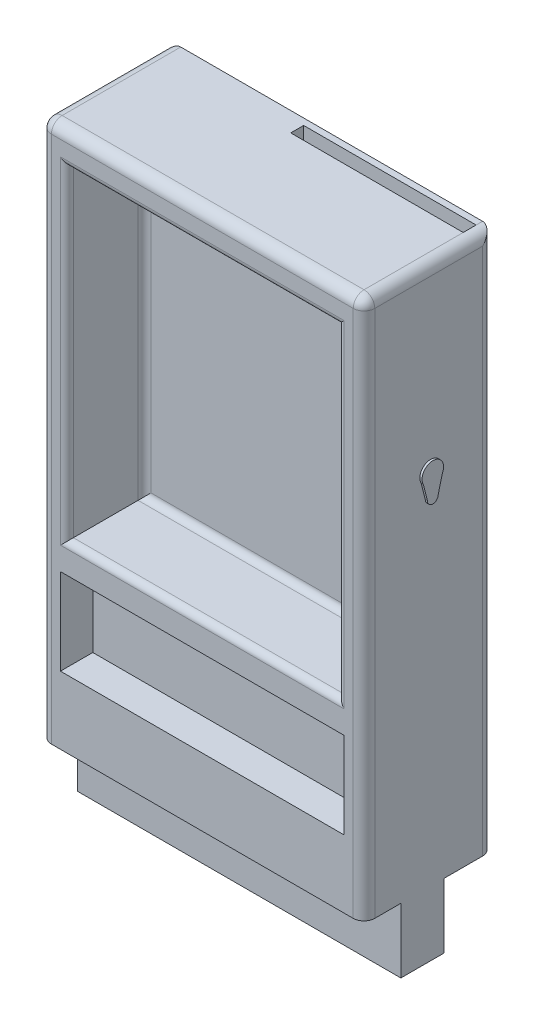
ISO-10303-21;
HEADER;
FILE_DESCRIPTION(('STEP AP214'),'2;1');
FILE_NAME('part.step','',(''),(''),'','','');
FILE_SCHEMA(('AUTOMOTIVE_DESIGN { 1 0 10303 214 1 1 1 1 }'));
ENDSEC;
DATA;
#1=APPLICATION_CONTEXT('core data for automotive mechanical design processes');
#2=APPLICATION_PROTOCOL_DEFINITION('international standard','automotive_design',2000,#1);
#3=PRODUCT_CONTEXT('',#1,'mechanical');
#4=PRODUCT('Part','Part','',(#3));
#5=PRODUCT_RELATED_PRODUCT_CATEGORY('part','',(#4));
#6=PRODUCT_DEFINITION_FORMATION('','',#4);
#7=PRODUCT_DEFINITION_CONTEXT('part definition',#1,'design');
#8=PRODUCT_DEFINITION('design','',#6,#7);
#9=PRODUCT_DEFINITION_SHAPE('','',#8);
#10=(LENGTH_UNIT() NAMED_UNIT(*) SI_UNIT(.MILLI.,.METRE.));
#11=(NAMED_UNIT(*) PLANE_ANGLE_UNIT() SI_UNIT($,.RADIAN.));
#12=(NAMED_UNIT(*) SI_UNIT($,.STERADIAN.) SOLID_ANGLE_UNIT());
#13=UNCERTAINTY_MEASURE_WITH_UNIT(LENGTH_MEASURE(1.E-05),#10,'distance_accuracy_value','');
#14=(GEOMETRIC_REPRESENTATION_CONTEXT(3) GLOBAL_UNCERTAINTY_ASSIGNED_CONTEXT((#13)) GLOBAL_UNIT_ASSIGNED_CONTEXT((#10,
#11,#12)) REPRESENTATION_CONTEXT('',''));
#15=CARTESIAN_POINT('',(0.,0.,0.));
#16=DIRECTION('',(0.,0.,1.));
#17=DIRECTION('',(1.,0.,0.));
#18=AXIS2_PLACEMENT_3D('',#15,#16,#17);
#19=CARTESIAN_POINT('',(381.,0.,152.4));
#20=DIRECTION('',(-1.,0.,0.));
#21=DIRECTION('',(0.,0.,1.));
#22=AXIS2_PLACEMENT_3D('',#19,#20,#21);
#23=PLANE('',#22);
#24=DIRECTION('',(0.,0.,-1.));
#25=VECTOR('',#24,1.);
#26=CARTESIAN_POINT('',(381.,0.,152.4));
#27=LINE('',#26,#25);
#28=CARTESIAN_POINT('',(381.,0.,139.7));
#29=VERTEX_POINT('',#28);
#30=CARTESIAN_POINT('',(381.,0.,108.992476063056));
#31=VERTEX_POINT('',#30);
#32=EDGE_CURVE('E395',#29,#31,#27,.T.);
#33=ORIENTED_EDGE('',*,*,#32,.T.);
#34=DIRECTION('',(0.,1.,0.));
#35=VECTOR('',#34,1.);
#36=CARTESIAN_POINT('',(381.,-76.2,108.992476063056));
#37=LINE('',#36,#35);
#38=CARTESIAN_POINT('',(381.,-76.2,108.992476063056));
#39=VERTEX_POINT('',#38);
#40=EDGE_CURVE('E297',#39,#31,#37,.T.);
#41=ORIENTED_EDGE('',*,*,#40,.F.);
#42=DIRECTION('',(0.,0.,1.));
#43=VECTOR('',#42,1.);
#44=CARTESIAN_POINT('',(381.,-76.2,108.992476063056));
#45=LINE('',#44,#43);
#46=CARTESIAN_POINT('',(381.,-76.2,58.1924760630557));
#47=VERTEX_POINT('',#46);
#48=EDGE_CURVE('E288',#47,#39,#45,.T.);
#49=ORIENTED_EDGE('',*,*,#48,.F.);
#50=DIRECTION('',(0.,1.,0.));
#51=VECTOR('',#50,1.);
#52=CARTESIAN_POINT('',(381.,-76.2,58.1924760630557));
#53=LINE('',#52,#51);
#54=CARTESIAN_POINT('',(381.,0.,58.1924760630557));
#55=VERTEX_POINT('',#54);
#56=EDGE_CURVE('E300',#47,#55,#53,.T.);
#57=ORIENTED_EDGE('',*,*,#56,.T.);
#58=CARTESIAN_POINT('',(381.,0.,12.7));
#59=VERTEX_POINT('',#58);
#60=EDGE_CURVE('E389',#55,#59,#27,.T.);
#61=ORIENTED_EDGE('',*,*,#60,.T.);
#62=DIRECTION('',(0.,1.,0.));
#63=VECTOR('',#62,1.);
#64=CARTESIAN_POINT('',(381.,635.,12.7));
#65=LINE('',#64,#63);
#66=CARTESIAN_POINT('',(381.,622.3,12.7));
#67=VERTEX_POINT('',#66);
#68=EDGE_CURVE('E433',#59,#67,#65,.T.);
#69=ORIENTED_EDGE('',*,*,#68,.T.);
#70=DIRECTION('',(0.,0.,-1.));
#71=VECTOR('',#70,1.);
#72=CARTESIAN_POINT('',(381.,622.3,152.4));
#73=LINE('',#72,#71);
#74=CARTESIAN_POINT('',(381.,622.3,139.7));
#75=VERTEX_POINT('',#74);
#76=EDGE_CURVE('E431',#67,#75,#73,.F.);
#77=ORIENTED_EDGE('',*,*,#76,.T.);
#78=DIRECTION('',(0.,1.,0.));
#79=VECTOR('',#78,1.);
#80=CARTESIAN_POINT('',(381.,0.,139.7));
#81=LINE('',#80,#79);
#82=EDGE_CURVE('E429',#75,#29,#81,.F.);
#83=ORIENTED_EDGE('',*,*,#82,.T.);
#84=EDGE_LOOP('',(#33,#41,#49,#57,#61,#69,#77,#83));
#85=FACE_BOUND('',#84,.T.);
#86=CARTESIAN_POINT('',(381.,397.500375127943,73.8843063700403));
#87=DIRECTION('',(1.,0.,0.));
#88=DIRECTION('',(0.,0.,-1.));
#89=AXIS2_PLACEMENT_3D('',#86,#87,#88);
#90=CIRCLE('',#89,6.34999999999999);
#91=CARTESIAN_POINT('',(381.,397.500375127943,80.2343063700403));
#92=VERTEX_POINT('',#91);
#93=CARTESIAN_POINT('',(381.,397.500375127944,67.5343063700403));
#94=VERTEX_POINT('',#93);
#95=EDGE_CURVE('E273',#92,#94,#90,.T.);
#96=ORIENTED_EDGE('',*,*,#95,.F.);
#97=DIRECTION('',(0.,-0.969553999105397,-0.244877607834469));
#98=VECTOR('',#97,1.);
#99=CARTESIAN_POINT('',(381.,416.611671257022,85.0611942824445));
#100=LINE('',#99,#98);
#101=CARTESIAN_POINT('',(381.,416.611671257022,85.0611942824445));
#102=VERTEX_POINT('',#101);
#103=EDGE_CURVE('E270',#102,#92,#100,.T.);
#104=ORIENTED_EDGE('',*,*,#103,.F.);
#105=CARTESIAN_POINT('',(381.,422.642191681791,73.8843063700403));
#106=DIRECTION('',(1.,0.,0.));
#107=DIRECTION('',(0.,0.,-1.));
#108=AXIS2_PLACEMENT_3D('',#105,#106,#107);
#109=CIRCLE('',#108,12.7);
#110=CARTESIAN_POINT('',(381.,416.611671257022,62.7074184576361));
#111=VERTEX_POINT('',#110);
#112=EDGE_CURVE('E58',#111,#102,#109,.T.);
#113=ORIENTED_EDGE('',*,*,#112,.F.);
#114=DIRECTION('',(0.,0.969553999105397,-0.244877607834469));
#115=VECTOR('',#114,1.);
#116=CARTESIAN_POINT('',(381.,416.611671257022,62.7074184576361));
#117=LINE('',#116,#115);
#118=EDGE_CURVE('E53',#94,#111,#117,.T.);
#119=ORIENTED_EDGE('',*,*,#118,.F.);
#120=EDGE_LOOP('',(#96,#104,#113,#119));
#121=FACE_BOUND('',#120,.T.);
#122=ADVANCED_FACE('F36',(#85,#121),#23,.F.);
#123=CARTESIAN_POINT('',(0.,0.,152.4));
#124=DIRECTION('',(0.,1.,0.));
#125=DIRECTION('',(0.,0.,1.));
#126=AXIS2_PLACEMENT_3D('',#123,#124,#125);
#127=PLANE('',#126);
#128=DIRECTION('',(-1.,0.,0.));
#129=VECTOR('',#128,1.);
#130=CARTESIAN_POINT('',(0.,0.,108.992476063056));
#131=LINE('',#130,#129);
#132=CARTESIAN_POINT('',(0.,0.,108.992476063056));
#133=VERTEX_POINT('',#132);
#134=EDGE_CURVE('E277',#31,#133,#131,.T.);
#135=ORIENTED_EDGE('',*,*,#134,.F.);
#136=ORIENTED_EDGE('',*,*,#32,.F.);
#137=CARTESIAN_POINT('',(368.3,0.,139.7));
#138=DIRECTION('',(0.,1.,0.));
#139=DIRECTION('',(0.,0.,1.));
#140=AXIS2_PLACEMENT_3D('',#137,#138,#139);
#141=CIRCLE('',#140,12.7);
#142=CARTESIAN_POINT('',(368.3,0.,152.4));
#143=VERTEX_POINT('',#142);
#144=EDGE_CURVE('E410',#29,#143,#141,.F.);
#145=ORIENTED_EDGE('',*,*,#144,.T.);
#146=DIRECTION('',(1.,0.,0.));
#147=VECTOR('',#146,1.);
#148=CARTESIAN_POINT('',(0.,0.,152.4));
#149=LINE('',#148,#147);
#150=CARTESIAN_POINT('',(12.7,0.,152.4));
#151=VERTEX_POINT('',#150);
#152=EDGE_CURVE('E386',#151,#143,#149,.T.);
#153=ORIENTED_EDGE('',*,*,#152,.F.);
#154=CARTESIAN_POINT('',(12.7,0.,139.7));
#155=DIRECTION('',(0.,1.,0.));
#156=DIRECTION('',(0.,0.,1.));
#157=AXIS2_PLACEMENT_3D('',#154,#155,#156);
#158=CIRCLE('',#157,12.7);
#159=CARTESIAN_POINT('',(0.,0.,139.7));
#160=VERTEX_POINT('',#159);
#161=EDGE_CURVE('E408',#151,#160,#158,.F.);
#162=ORIENTED_EDGE('',*,*,#161,.T.);
#163=DIRECTION('',(0.,0.,-1.));
#164=VECTOR('',#163,1.);
#165=CARTESIAN_POINT('',(0.,0.,152.4));
#166=LINE('',#165,#164);
#167=EDGE_CURVE('E399',#160,#133,#166,.T.);
#168=ORIENTED_EDGE('',*,*,#167,.T.);
#169=EDGE_LOOP('',(#135,#136,#145,#153,#162,#168));
#170=FACE_BOUND('',#169,.T.);
#171=ADVANCED_FACE('F590',(#170),#127,.F.);
#172=DIRECTION('',(1.,0.,0.));
#173=VECTOR('',#172,1.);
#174=CARTESIAN_POINT('',(0.,0.,58.1924760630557));
#175=LINE('',#174,#173);
#176=CARTESIAN_POINT('',(0.,0.,58.1924760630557));
#177=VERTEX_POINT('',#176);
#178=EDGE_CURVE('E274',#177,#55,#175,.T.);
#179=ORIENTED_EDGE('',*,*,#178,.F.);
#180=CARTESIAN_POINT('',(0.,0.,12.7));
#181=VERTEX_POINT('',#180);
#182=EDGE_CURVE('E398',#177,#181,#166,.T.);
#183=ORIENTED_EDGE('',*,*,#182,.T.);
#184=CARTESIAN_POINT('',(12.7,0.,12.7));
#185=DIRECTION('',(0.,1.,0.));
#186=DIRECTION('',(0.,0.,1.));
#187=AXIS2_PLACEMENT_3D('',#184,#185,#186);
#188=CIRCLE('',#187,12.7);
#189=CARTESIAN_POINT('',(12.7,0.,0.));
#190=VERTEX_POINT('',#189);
#191=EDGE_CURVE('E415',#181,#190,#188,.F.);
#192=ORIENTED_EDGE('',*,*,#191,.T.);
#193=DIRECTION('',(1.,0.,0.));
#194=VECTOR('',#193,1.);
#195=CARTESIAN_POINT('',(0.,0.,0.));
#196=LINE('',#195,#194);
#197=CARTESIAN_POINT('',(368.3,0.,0.));
#198=VERTEX_POINT('',#197);
#199=EDGE_CURVE('E379',#190,#198,#196,.T.);
#200=ORIENTED_EDGE('',*,*,#199,.T.);
#201=CARTESIAN_POINT('',(368.3,0.,12.7));
#202=DIRECTION('',(0.,1.,0.));
#203=DIRECTION('',(0.,0.,1.));
#204=AXIS2_PLACEMENT_3D('',#201,#202,#203);
#205=CIRCLE('',#204,12.7);
#206=EDGE_CURVE('E412',#198,#59,#205,.F.);
#207=ORIENTED_EDGE('',*,*,#206,.T.);
#208=ORIENTED_EDGE('',*,*,#60,.F.);
#209=EDGE_LOOP('',(#179,#183,#192,#200,#207,#208));
#210=FACE_BOUND('',#209,.T.);
#211=ADVANCED_FACE('F646',(#210),#127,.F.);
#212=CARTESIAN_POINT('',(0.,0.,152.4));
#213=DIRECTION('',(1.,0.,0.));
#214=DIRECTION('',(0.,0.,-1.));
#215=AXIS2_PLACEMENT_3D('',#212,#213,#214);
#216=PLANE('',#215);
#217=DIRECTION('',(0.,0.,-1.));
#218=VECTOR('',#217,1.);
#219=CARTESIAN_POINT('',(0.,622.3,152.4));
#220=LINE('',#219,#218);
#221=CARTESIAN_POINT('',(0.,622.3,139.7));
#222=VERTEX_POINT('',#221);
#223=CARTESIAN_POINT('',(0.,622.3,12.7));
#224=VERTEX_POINT('',#223);
#225=EDGE_CURVE('E403',#222,#224,#220,.T.);
#226=ORIENTED_EDGE('',*,*,#225,.T.);
#227=DIRECTION('',(0.,-1.,0.));
#228=VECTOR('',#227,1.);
#229=CARTESIAN_POINT('',(0.,0.,12.7));
#230=LINE('',#229,#228);
#231=EDGE_CURVE('E405',#224,#181,#230,.T.);
#232=ORIENTED_EDGE('',*,*,#231,.T.);
#233=ORIENTED_EDGE('',*,*,#182,.F.);
#234=DIRECTION('',(0.,1.,0.));
#235=VECTOR('',#234,1.);
#236=CARTESIAN_POINT('',(0.,-76.2,58.1924760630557));
#237=LINE('',#236,#235);
#238=CARTESIAN_POINT('',(0.,-76.2,58.1924760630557));
#239=VERTEX_POINT('',#238);
#240=EDGE_CURVE('E303',#239,#177,#237,.T.);
#241=ORIENTED_EDGE('',*,*,#240,.F.);
#242=DIRECTION('',(0.,0.,-1.));
#243=VECTOR('',#242,1.);
#244=CARTESIAN_POINT('',(0.,-76.2,108.992476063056));
#245=LINE('',#244,#243);
#246=CARTESIAN_POINT('',(0.,-76.2,108.992476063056));
#247=VERTEX_POINT('',#246);
#248=EDGE_CURVE('E283',#247,#239,#245,.T.);
#249=ORIENTED_EDGE('',*,*,#248,.F.);
#250=DIRECTION('',(0.,1.,0.));
#251=VECTOR('',#250,1.);
#252=CARTESIAN_POINT('',(0.,-76.2,108.992476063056));
#253=LINE('',#252,#251);
#254=EDGE_CURVE('E291',#247,#133,#253,.T.);
#255=ORIENTED_EDGE('',*,*,#254,.T.);
#256=ORIENTED_EDGE('',*,*,#167,.F.);
#257=DIRECTION('',(0.,-1.,0.));
#258=VECTOR('',#257,1.);
#259=CARTESIAN_POINT('',(0.,0.,139.7));
#260=LINE('',#259,#258);
#261=EDGE_CURVE('E401',#160,#222,#260,.F.);
#262=ORIENTED_EDGE('',*,*,#261,.T.);
#263=EDGE_LOOP('',(#226,#232,#233,#241,#249,#255,#256,#262));
#264=FACE_BOUND('',#263,.T.);
#265=ADVANCED_FACE('F592',(#264),#216,.F.);
#266=CARTESIAN_POINT('',(0.,635.,152.4));
#267=DIRECTION('',(0.,-1.,0.));
#268=DIRECTION('',(0.,0.,-1.));
#269=AXIS2_PLACEMENT_3D('',#266,#267,#268);
#270=PLANE('',#269);
#271=DIRECTION('',(-1.,0.,0.));
#272=VECTOR('',#271,1.);
#273=CARTESIAN_POINT('',(368.3,635.,7.62));
#274=LINE('',#273,#272);
#275=CARTESIAN_POINT('',(368.3,635.,7.62));
#276=VERTEX_POINT('',#275);
#277=CARTESIAN_POINT('',(165.1,635.,7.62000000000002));
#278=VERTEX_POINT('',#277);
#279=EDGE_CURVE('E368',#276,#278,#274,.T.);
#280=ORIENTED_EDGE('',*,*,#279,.F.);
#281=DIRECTION('',(0.,0.,-1.));
#282=VECTOR('',#281,1.);
#283=CARTESIAN_POINT('',(368.3,635.,152.4));
#284=LINE('',#283,#282);
#285=CARTESIAN_POINT('',(368.3,635.,0.));
#286=VERTEX_POINT('',#285);
#287=EDGE_CURVE('E427',#276,#286,#284,.T.);
#288=ORIENTED_EDGE('',*,*,#287,.T.);
#289=DIRECTION('',(-1.,0.,0.));
#290=VECTOR('',#289,1.);
#291=CARTESIAN_POINT('',(0.,635.,0.));
#292=LINE('',#291,#290);
#293=CARTESIAN_POINT('',(12.7,635.,0.));
#294=VERTEX_POINT('',#293);
#295=EDGE_CURVE('E390',#286,#294,#292,.T.);
#296=ORIENTED_EDGE('',*,*,#295,.T.);
#297=DIRECTION('',(0.,0.,-1.));
#298=VECTOR('',#297,1.);
#299=CARTESIAN_POINT('',(12.7,635.,152.4));
#300=LINE('',#299,#298);
#301=CARTESIAN_POINT('',(12.7,635.,139.7));
#302=VERTEX_POINT('',#301);
#303=EDGE_CURVE('E425',#294,#302,#300,.F.);
#304=ORIENTED_EDGE('',*,*,#303,.T.);
#305=DIRECTION('',(-1.,0.,0.));
#306=VECTOR('',#305,1.);
#307=CARTESIAN_POINT('',(0.,635.,139.7));
#308=LINE('',#307,#306);
#309=CARTESIAN_POINT('',(368.3,635.,139.7));
#310=VERTEX_POINT('',#309);
#311=EDGE_CURVE('E421',#302,#310,#308,.F.);
#312=ORIENTED_EDGE('',*,*,#311,.T.);
#313=DIRECTION('',(0.,0.,-1.));
#314=VECTOR('',#313,1.);
#315=CARTESIAN_POINT('',(368.3,635.,152.4));
#316=LINE('',#315,#314);
#317=CARTESIAN_POINT('',(368.3,635.,22.86));
#318=VERTEX_POINT('',#317);
#319=EDGE_CURVE('E423',#310,#318,#316,.T.);
#320=ORIENTED_EDGE('',*,*,#319,.T.);
#321=DIRECTION('',(1.,0.,0.));
#322=VECTOR('',#321,1.);
#323=CARTESIAN_POINT('',(368.3,635.,22.86));
#324=LINE('',#323,#322);
#325=CARTESIAN_POINT('',(165.1,635.,22.86));
#326=VERTEX_POINT('',#325);
#327=EDGE_CURVE('E357',#326,#318,#324,.T.);
#328=ORIENTED_EDGE('',*,*,#327,.F.);
#329=DIRECTION('',(0.,0.,1.));
#330=VECTOR('',#329,1.);
#331=CARTESIAN_POINT('',(165.1,635.,22.86));
#332=LINE('',#331,#330);
#333=EDGE_CURVE('E371',#278,#326,#332,.T.);
#334=ORIENTED_EDGE('',*,*,#333,.F.);
#335=EDGE_LOOP('',(#280,#288,#296,#304,#312,#320,#328,#334));
#336=FACE_BOUND('',#335,.T.);
#337=ADVANCED_FACE('F562',(#336),#270,.F.);
#338=CARTESIAN_POINT('',(0.,0.,152.4));
#339=DIRECTION('',(0.,0.,-1.));
#340=DIRECTION('',(-1.,0.,0.));
#341=AXIS2_PLACEMENT_3D('',#338,#339,#340);
#342=PLANE('',#341);
#343=DIRECTION('',(1.,0.,0.));
#344=VECTOR('',#343,1.);
#345=CARTESIAN_POINT('',(357.632,79.7466470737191,152.4));
#346=LINE('',#345,#344);
#347=CARTESIAN_POINT('',(23.3933877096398,79.7466470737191,152.4));
#348=VERTEX_POINT('',#347);
#349=CARTESIAN_POINT('',(357.632,79.7466470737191,152.4));
#350=VERTEX_POINT('',#349);
#351=EDGE_CURVE('E322',#348,#350,#346,.T.);
#352=ORIENTED_EDGE('',*,*,#351,.F.);
#353=DIRECTION('',(0.,-1.,0.));
#354=VECTOR('',#353,1.);
#355=CARTESIAN_POINT('',(23.3933877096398,79.7466470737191,152.4));
#356=LINE('',#355,#354);
#357=CARTESIAN_POINT('',(23.3933877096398,181.346647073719,152.4));
#358=VERTEX_POINT('',#357);
#359=EDGE_CURVE('E306',#358,#348,#356,.T.);
#360=ORIENTED_EDGE('',*,*,#359,.F.);
#361=DIRECTION('',(-1.,0.,0.));
#362=VECTOR('',#361,1.);
#363=CARTESIAN_POINT('',(23.3933877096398,181.346647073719,152.4));
#364=LINE('',#363,#362);
#365=CARTESIAN_POINT('',(357.632,181.346647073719,152.4));
#366=VERTEX_POINT('',#365);
#367=EDGE_CURVE('E311',#366,#358,#364,.T.);
#368=ORIENTED_EDGE('',*,*,#367,.F.);
#369=DIRECTION('',(0.,1.,0.));
#370=VECTOR('',#369,1.);
#371=CARTESIAN_POINT('',(357.632,181.346647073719,152.4));
#372=LINE('',#371,#370);
#373=EDGE_CURVE('E325',#350,#366,#372,.T.);
#374=ORIENTED_EDGE('',*,*,#373,.F.);
#375=EDGE_LOOP('',(#352,#360,#368,#374));
#376=FACE_BOUND('',#375,.T.);
#377=DIRECTION('',(0.,-1.,0.));
#378=VECTOR('',#377,1.);
#379=CARTESIAN_POINT('',(23.3933877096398,0.,152.4));
#380=LINE('',#379,#378);
#381=CARTESIAN_POINT('',(23.3933877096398,208.28,152.4));
#382=VERTEX_POINT('',#381);
#383=CARTESIAN_POINT('',(23.3933877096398,604.52,152.4));
#384=VERTEX_POINT('',#383);
#385=EDGE_CURVE('E470',#382,#384,#380,.F.);
#386=ORIENTED_EDGE('',*,*,#385,.T.);
#387=DIRECTION('',(-1.,0.,0.));
#388=VECTOR('',#387,1.);
#389=CARTESIAN_POINT('',(0.,604.52,152.4));
#390=LINE('',#389,#388);
#391=CARTESIAN_POINT('',(357.632,604.52,152.4));
#392=VERTEX_POINT('',#391);
#393=EDGE_CURVE('E476',#384,#392,#390,.F.);
#394=ORIENTED_EDGE('',*,*,#393,.T.);
#395=DIRECTION('',(0.,1.,0.));
#396=VECTOR('',#395,1.);
#397=CARTESIAN_POINT('',(357.632,0.,152.4));
#398=LINE('',#397,#396);
#399=CARTESIAN_POINT('',(357.632,208.28,152.4));
#400=VERTEX_POINT('',#399);
#401=EDGE_CURVE('E474',#392,#400,#398,.F.);
#402=ORIENTED_EDGE('',*,*,#401,.T.);
#403=DIRECTION('',(1.,0.,0.));
#404=VECTOR('',#403,1.);
#405=CARTESIAN_POINT('',(0.,208.28,152.4));
#406=LINE('',#405,#404);
#407=EDGE_CURVE('E472',#400,#382,#406,.F.);
#408=ORIENTED_EDGE('',*,*,#407,.T.);
#409=EDGE_LOOP('',(#386,#394,#402,#408));
#410=FACE_BOUND('',#409,.T.);
#411=ORIENTED_EDGE('',*,*,#152,.T.);
#412=DIRECTION('',(0.,1.,0.));
#413=VECTOR('',#412,1.);
#414=CARTESIAN_POINT('',(368.3,0.,152.4));
#415=LINE('',#414,#413);
#416=CARTESIAN_POINT('',(368.3,622.3,152.4));
#417=VERTEX_POINT('',#416);
#418=EDGE_CURVE('E439',#143,#417,#415,.T.);
#419=ORIENTED_EDGE('',*,*,#418,.T.);
#420=DIRECTION('',(-1.,0.,0.));
#421=VECTOR('',#420,1.);
#422=CARTESIAN_POINT('',(0.,622.3,152.4));
#423=LINE('',#422,#421);
#424=CARTESIAN_POINT('',(12.7,622.3,152.4));
#425=VERTEX_POINT('',#424);
#426=EDGE_CURVE('E437',#417,#425,#423,.T.);
#427=ORIENTED_EDGE('',*,*,#426,.T.);
#428=DIRECTION('',(0.,-1.,0.));
#429=VECTOR('',#428,1.);
#430=CARTESIAN_POINT('',(12.7,0.,152.4));
#431=LINE('',#430,#429);
#432=EDGE_CURVE('E435',#425,#151,#431,.T.);
#433=ORIENTED_EDGE('',*,*,#432,.T.);
#434=EDGE_LOOP('',(#411,#419,#427,#433));
#435=FACE_BOUND('',#434,.T.);
#436=ADVANCED_FACE('F558',(#376,#410,#435),#342,.F.);
#437=CARTESIAN_POINT('',(0.,0.,0.));
#438=DIRECTION('',(0.,0.,-1.));
#439=DIRECTION('',(-1.,0.,0.));
#440=AXIS2_PLACEMENT_3D('',#437,#438,#439);
#441=PLANE('',#440);
#442=ORIENTED_EDGE('',*,*,#199,.F.);
#443=DIRECTION('',(0.,-1.,0.));
#444=VECTOR('',#443,1.);
#445=CARTESIAN_POINT('',(12.7,635.,0.));
#446=LINE('',#445,#444);
#447=EDGE_CURVE('E419',#190,#294,#446,.F.);
#448=ORIENTED_EDGE('',*,*,#447,.T.);
#449=ORIENTED_EDGE('',*,*,#295,.F.);
#450=DIRECTION('',(0.,1.,0.));
#451=VECTOR('',#450,1.);
#452=CARTESIAN_POINT('',(368.3,0.,0.));
#453=LINE('',#452,#451);
#454=EDGE_CURVE('E417',#286,#198,#453,.F.);
#455=ORIENTED_EDGE('',*,*,#454,.T.);
#456=EDGE_LOOP('',(#442,#448,#449,#455));
#457=FACE_BOUND('',#456,.T.);
#458=ADVANCED_FACE('F561',(#457),#441,.T.);
#459=CARTESIAN_POINT('',(368.3,254.,22.86));
#460=DIRECTION('',(1.,0.,0.));
#461=DIRECTION('',(0.,0.,-1.));
#462=AXIS2_PLACEMENT_3D('',#459,#460,#461);
#463=PLANE('',#462);
#464=DIRECTION('',(0.,0.,-1.));
#465=VECTOR('',#464,1.);
#466=CARTESIAN_POINT('',(368.3,635.,22.86));
#467=LINE('',#466,#465);
#468=EDGE_CURVE('E352',#318,#276,#467,.T.);
#469=ORIENTED_EDGE('',*,*,#468,.T.);
#470=DIRECTION('',(0.,1.,0.));
#471=VECTOR('',#470,1.);
#472=CARTESIAN_POINT('',(368.3,254.,7.62));
#473=LINE('',#472,#471);
#474=CARTESIAN_POINT('',(368.3,254.,7.62));
#475=VERTEX_POINT('',#474);
#476=EDGE_CURVE('E366',#475,#276,#473,.T.);
#477=ORIENTED_EDGE('',*,*,#476,.F.);
#478=DIRECTION('',(0.,0.,-1.));
#479=VECTOR('',#478,1.);
#480=CARTESIAN_POINT('',(368.3,254.,22.86));
#481=LINE('',#480,#479);
#482=CARTESIAN_POINT('',(368.3,254.,22.86));
#483=VERTEX_POINT('',#482);
#484=EDGE_CURVE('E353',#483,#475,#481,.T.);
#485=ORIENTED_EDGE('',*,*,#484,.F.);
#486=DIRECTION('',(0.,1.,0.));
#487=VECTOR('',#486,1.);
#488=CARTESIAN_POINT('',(368.3,254.,22.86));
#489=LINE('',#488,#487);
#490=EDGE_CURVE('E376',#483,#318,#489,.T.);
#491=ORIENTED_EDGE('',*,*,#490,.T.);
#492=EDGE_LOOP('',(#469,#477,#485,#491));
#493=FACE_BOUND('',#492,.T.);
#494=ADVANCED_FACE('F617',(#493),#463,.F.);
#495=CARTESIAN_POINT('',(368.3,254.,22.86));
#496=DIRECTION('',(0.,0.,1.));
#497=DIRECTION('',(1.,0.,0.));
#498=AXIS2_PLACEMENT_3D('',#495,#496,#497);
#499=PLANE('',#498);
#500=ORIENTED_EDGE('',*,*,#327,.T.);
#501=ORIENTED_EDGE('',*,*,#490,.F.);
#502=DIRECTION('',(1.,0.,0.));
#503=VECTOR('',#502,1.);
#504=CARTESIAN_POINT('',(368.3,254.,22.86));
#505=LINE('',#504,#503);
#506=CARTESIAN_POINT('',(165.1,254.,22.86));
#507=VERTEX_POINT('',#506);
#508=EDGE_CURVE('E363',#507,#483,#505,.T.);
#509=ORIENTED_EDGE('',*,*,#508,.F.);
#510=DIRECTION('',(0.,1.,0.));
#511=VECTOR('',#510,1.);
#512=CARTESIAN_POINT('',(165.1,254.,22.86));
#513=LINE('',#512,#511);
#514=EDGE_CURVE('E380',#507,#326,#513,.T.);
#515=ORIENTED_EDGE('',*,*,#514,.T.);
#516=EDGE_LOOP('',(#500,#501,#509,#515));
#517=FACE_BOUND('',#516,.T.);
#518=ADVANCED_FACE('F620',(#517),#499,.F.);
#519=CARTESIAN_POINT('',(165.1,254.,22.86));
#520=DIRECTION('',(-1.,0.,0.));
#521=DIRECTION('',(0.,0.,1.));
#522=AXIS2_PLACEMENT_3D('',#519,#520,#521);
#523=PLANE('',#522);
#524=ORIENTED_EDGE('',*,*,#333,.T.);
#525=ORIENTED_EDGE('',*,*,#514,.F.);
#526=DIRECTION('',(0.,0.,1.));
#527=VECTOR('',#526,1.);
#528=CARTESIAN_POINT('',(165.1,254.,22.86));
#529=LINE('',#528,#527);
#530=CARTESIAN_POINT('',(165.1,254.,7.62000000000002));
#531=VERTEX_POINT('',#530);
#532=EDGE_CURVE('E360',#531,#507,#529,.T.);
#533=ORIENTED_EDGE('',*,*,#532,.F.);
#534=DIRECTION('',(0.,1.,0.));
#535=VECTOR('',#534,1.);
#536=CARTESIAN_POINT('',(165.1,254.,7.62000000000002));
#537=LINE('',#536,#535);
#538=EDGE_CURVE('E382',#531,#278,#537,.T.);
#539=ORIENTED_EDGE('',*,*,#538,.T.);
#540=EDGE_LOOP('',(#524,#525,#533,#539));
#541=FACE_BOUND('',#540,.T.);
#542=ADVANCED_FACE('F623',(#541),#523,.F.);
#543=CARTESIAN_POINT('',(368.3,254.,7.62));
#544=DIRECTION('',(0.,0.,-1.));
#545=DIRECTION('',(-1.,0.,0.));
#546=AXIS2_PLACEMENT_3D('',#543,#544,#545);
#547=PLANE('',#546);
#548=ORIENTED_EDGE('',*,*,#279,.T.);
#549=ORIENTED_EDGE('',*,*,#538,.F.);
#550=DIRECTION('',(-1.,0.,0.));
#551=VECTOR('',#550,1.);
#552=CARTESIAN_POINT('',(368.3,254.,7.62));
#553=LINE('',#552,#551);
#554=EDGE_CURVE('E356',#475,#531,#553,.T.);
#555=ORIENTED_EDGE('',*,*,#554,.F.);
#556=ORIENTED_EDGE('',*,*,#476,.T.);
#557=EDGE_LOOP('',(#548,#549,#555,#556));
#558=FACE_BOUND('',#557,.T.);
#559=ADVANCED_FACE('F626',(#558),#547,.F.);
#560=CARTESIAN_POINT('',(0.,254.,0.));
#561=DIRECTION('',(0.,1.,0.));
#562=DIRECTION('',(0.,0.,1.));
#563=AXIS2_PLACEMENT_3D('',#560,#561,#562);
#564=PLANE('',#563);
#565=ORIENTED_EDGE('',*,*,#484,.T.);
#566=ORIENTED_EDGE('',*,*,#554,.T.);
#567=ORIENTED_EDGE('',*,*,#532,.T.);
#568=ORIENTED_EDGE('',*,*,#508,.T.);
#569=EDGE_LOOP('',(#565,#566,#567,#568));
#570=FACE_BOUND('',#569,.T.);
#571=ADVANCED_FACE('F629',(#570),#564,.T.);
#572=CARTESIAN_POINT('',(0.,0.,60.96));
#573=DIRECTION('',(0.,0.,-1.));
#574=DIRECTION('',(-1.,0.,0.));
#575=AXIS2_PLACEMENT_3D('',#572,#573,#574);
#576=PLANE('',#575);
#577=DIRECTION('',(0.,-1.,0.));
#578=VECTOR('',#577,1.);
#579=CARTESIAN_POINT('',(38.6333877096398,215.9,60.96));
#580=LINE('',#579,#578);
#581=CARTESIAN_POINT('',(38.6333877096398,589.28,60.96));
#582=VERTEX_POINT('',#581);
#583=CARTESIAN_POINT('',(38.6333877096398,223.52,60.96));
#584=VERTEX_POINT('',#583);
#585=EDGE_CURVE('E492',#582,#584,#580,.T.);
#586=ORIENTED_EDGE('',*,*,#585,.T.);
#587=DIRECTION('',(1.,0.,0.));
#588=VECTOR('',#587,1.);
#589=CARTESIAN_POINT('',(350.012,223.52,60.96));
#590=LINE('',#589,#588);
#591=CARTESIAN_POINT('',(342.392,223.52,60.96));
#592=VERTEX_POINT('',#591);
#593=EDGE_CURVE('E12',#584,#592,#590,.T.);
#594=ORIENTED_EDGE('',*,*,#593,.T.);
#595=DIRECTION('',(0.,1.,0.));
#596=VECTOR('',#595,1.);
#597=CARTESIAN_POINT('',(342.392,596.9,60.96));
#598=LINE('',#597,#596);
#599=CARTESIAN_POINT('',(342.392,589.28,60.96));
#600=VERTEX_POINT('',#599);
#601=EDGE_CURVE('E45',#592,#600,#598,.T.);
#602=ORIENTED_EDGE('',*,*,#601,.T.);
#603=DIRECTION('',(-1.,0.,0.));
#604=VECTOR('',#603,1.);
#605=CARTESIAN_POINT('',(31.0133877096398,589.28,60.96));
#606=LINE('',#605,#604);
#607=EDGE_CURVE('E494',#600,#582,#606,.T.);
#608=ORIENTED_EDGE('',*,*,#607,.T.);
#609=EDGE_LOOP('',(#586,#594,#602,#608));
#610=FACE_BOUND('',#609,.T.);
#611=ADVANCED_FACE('F631',(#610),#576,.F.);
#612=CARTESIAN_POINT('',(31.0133877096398,215.9,-496.911576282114));
#613=DIRECTION('',(0.,-1.,0.));
#614=DIRECTION('',(0.,0.,-1.));
#615=AXIS2_PLACEMENT_3D('',#612,#613,#614);
#616=PLANE('',#615);
#617=DIRECTION('',(0.,0.,1.));
#618=VECTOR('',#617,1.);
#619=CARTESIAN_POINT('',(31.0133877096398,215.9,-496.911576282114));
#620=LINE('',#619,#618);
#621=CARTESIAN_POINT('',(31.0133877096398,215.9,68.58));
#622=VERTEX_POINT('',#621);
#623=CARTESIAN_POINT('',(31.0133877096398,215.9,144.78));
#624=VERTEX_POINT('',#623);
#625=EDGE_CURVE('E342',#622,#624,#620,.T.);
#626=ORIENTED_EDGE('',*,*,#625,.T.);
#627=DIRECTION('',(1.,0.,0.));
#628=VECTOR('',#627,1.);
#629=CARTESIAN_POINT('',(31.0133877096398,215.9,144.78));
#630=LINE('',#629,#628);
#631=CARTESIAN_POINT('',(350.012,215.9,144.78));
#632=VERTEX_POINT('',#631);
#633=EDGE_CURVE('E486',#624,#632,#630,.T.);
#634=ORIENTED_EDGE('',*,*,#633,.T.);
#635=DIRECTION('',(0.,0.,1.));
#636=VECTOR('',#635,1.);
#637=CARTESIAN_POINT('',(350.012,215.9,-496.911576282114));
#638=LINE('',#637,#636);
#639=CARTESIAN_POINT('',(350.012,215.9,68.58));
#640=VERTEX_POINT('',#639);
#641=EDGE_CURVE('E346',#640,#632,#638,.T.);
#642=ORIENTED_EDGE('',*,*,#641,.F.);
#643=DIRECTION('',(1.,0.,0.));
#644=VECTOR('',#643,1.);
#645=CARTESIAN_POINT('',(31.0133877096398,215.9,68.58));
#646=LINE('',#645,#644);
#647=EDGE_CURVE('E483',#640,#622,#646,.F.);
#648=ORIENTED_EDGE('',*,*,#647,.T.);
#649=EDGE_LOOP('',(#626,#634,#642,#648));
#650=FACE_BOUND('',#649,.T.);
#651=ADVANCED_FACE('F548',(#650),#616,.F.);
#652=CARTESIAN_POINT('',(350.012,596.9,-496.911576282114));
#653=DIRECTION('',(1.,0.,0.));
#654=DIRECTION('',(0.,1.,0.));
#655=AXIS2_PLACEMENT_3D('',#652,#653,#654);
#656=PLANE('',#655);
#657=ORIENTED_EDGE('',*,*,#641,.T.);
#658=DIRECTION('',(0.,1.,0.));
#659=VECTOR('',#658,1.);
#660=CARTESIAN_POINT('',(350.012,596.9,144.78));
#661=LINE('',#660,#659);
#662=CARTESIAN_POINT('',(350.012,596.9,144.78));
#663=VERTEX_POINT('',#662);
#664=EDGE_CURVE('E481',#632,#663,#661,.T.);
#665=ORIENTED_EDGE('',*,*,#664,.T.);
#666=DIRECTION('',(0.,0.,1.));
#667=VECTOR('',#666,1.);
#668=CARTESIAN_POINT('',(350.012,596.9,-496.911576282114));
#669=LINE('',#668,#667);
#670=CARTESIAN_POINT('',(350.012,596.9,68.58));
#671=VERTEX_POINT('',#670);
#672=EDGE_CURVE('E343',#671,#663,#669,.T.);
#673=ORIENTED_EDGE('',*,*,#672,.F.);
#674=DIRECTION('',(0.,1.,0.));
#675=VECTOR('',#674,1.);
#676=CARTESIAN_POINT('',(350.012,215.9,68.58));
#677=LINE('',#676,#675);
#678=EDGE_CURVE('E479',#671,#640,#677,.F.);
#679=ORIENTED_EDGE('',*,*,#678,.T.);
#680=EDGE_LOOP('',(#657,#665,#673,#679));
#681=FACE_BOUND('',#680,.T.);
#682=ADVANCED_FACE('F530',(#681),#656,.F.);
#683=CARTESIAN_POINT('',(31.0133877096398,596.9,-496.911576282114));
#684=DIRECTION('',(0.,1.,0.));
#685=DIRECTION('',(0.,0.,1.));
#686=AXIS2_PLACEMENT_3D('',#683,#684,#685);
#687=PLANE('',#686);
#688=ORIENTED_EDGE('',*,*,#672,.T.);
#689=DIRECTION('',(-1.,0.,0.));
#690=VECTOR('',#689,1.);
#691=CARTESIAN_POINT('',(31.0133877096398,596.9,144.78));
#692=LINE('',#691,#690);
#693=CARTESIAN_POINT('',(31.0133877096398,596.9,144.78));
#694=VERTEX_POINT('',#693);
#695=EDGE_CURVE('E467',#663,#694,#692,.T.);
#696=ORIENTED_EDGE('',*,*,#695,.T.);
#697=DIRECTION('',(0.,0.,1.));
#698=VECTOR('',#697,1.);
#699=CARTESIAN_POINT('',(31.0133877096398,596.9,-496.911576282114));
#700=LINE('',#699,#698);
#701=CARTESIAN_POINT('',(31.0133877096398,596.9,68.58));
#702=VERTEX_POINT('',#701);
#703=EDGE_CURVE('E339',#702,#694,#700,.T.);
#704=ORIENTED_EDGE('',*,*,#703,.F.);
#705=DIRECTION('',(-1.,0.,0.));
#706=VECTOR('',#705,1.);
#707=CARTESIAN_POINT('',(350.012,596.9,68.58));
#708=LINE('',#707,#706);
#709=EDGE_CURVE('E441',#702,#671,#708,.F.);
#710=ORIENTED_EDGE('',*,*,#709,.T.);
#711=EDGE_LOOP('',(#688,#696,#704,#710));
#712=FACE_BOUND('',#711,.T.);
#713=ADVANCED_FACE('F527',(#712),#687,.F.);
#714=CARTESIAN_POINT('',(31.0133877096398,596.9,-496.911576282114));
#715=DIRECTION('',(-1.,0.,0.));
#716=DIRECTION('',(0.,-1.,0.));
#717=AXIS2_PLACEMENT_3D('',#714,#715,#716);
#718=PLANE('',#717);
#719=ORIENTED_EDGE('',*,*,#703,.T.);
#720=DIRECTION('',(0.,-1.,0.));
#721=VECTOR('',#720,1.);
#722=CARTESIAN_POINT('',(31.0133877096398,596.9,144.78));
#723=LINE('',#722,#721);
#724=EDGE_CURVE('E490',#694,#624,#723,.T.);
#725=ORIENTED_EDGE('',*,*,#724,.T.);
#726=ORIENTED_EDGE('',*,*,#625,.F.);
#727=DIRECTION('',(0.,-1.,0.));
#728=VECTOR('',#727,1.);
#729=CARTESIAN_POINT('',(31.0133877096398,596.9,68.58));
#730=LINE('',#729,#728);
#731=EDGE_CURVE('E488',#622,#702,#730,.F.);
#732=ORIENTED_EDGE('',*,*,#731,.T.);
#733=EDGE_LOOP('',(#719,#725,#726,#732));
#734=FACE_BOUND('',#733,.T.);
#735=ADVANCED_FACE('F544',(#734),#718,.F.);
#736=CARTESIAN_POINT('',(368.3,0.,12.7));
#737=DIRECTION('',(0.,-1.,0.));
#738=DIRECTION('',(0.,0.,-1.));
#739=AXIS2_PLACEMENT_3D('',#736,#737,#738);
#740=CYLINDRICAL_SURFACE('',#739,12.7);
#741=ORIENTED_EDGE('',*,*,#206,.F.);
#742=ORIENTED_EDGE('',*,*,#454,.F.);
#743=CARTESIAN_POINT('',(368.3,622.3,12.7));
#744=DIRECTION('',(0.,-0.707106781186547,-0.707106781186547));
#745=DIRECTION('',(0.,0.707106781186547,-0.707106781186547));
#746=AXIS2_PLACEMENT_3D('',#743,#744,#745);
#747=ELLIPSE('',#746,17.9605122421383,12.7);
#748=EDGE_CURVE('E349',#67,#286,#747,.F.);
#749=ORIENTED_EDGE('',*,*,#748,.F.);
#750=ORIENTED_EDGE('',*,*,#68,.F.);
#751=EDGE_LOOP('',(#741,#742,#749,#750));
#752=FACE_BOUND('',#751,.T.);
#753=ADVANCED_FACE('F675',(#752),#740,.T.);
#754=CARTESIAN_POINT('',(368.3,622.3,152.4));
#755=DIRECTION('',(0.,0.,-1.));
#756=DIRECTION('',(-1.,0.,0.));
#757=AXIS2_PLACEMENT_3D('',#754,#755,#756);
#758=CYLINDRICAL_SURFACE('',#757,12.7);
#759=ORIENTED_EDGE('',*,*,#468,.F.);
#760=ORIENTED_EDGE('',*,*,#319,.F.);
#761=CARTESIAN_POINT('',(368.3,622.3,139.7));
#762=DIRECTION('',(0.,0.,1.));
#763=DIRECTION('',(1.,0.,0.));
#764=AXIS2_PLACEMENT_3D('',#761,#762,#763);
#765=CIRCLE('',#764,12.7);
#766=EDGE_CURVE('E461',#75,#310,#765,.T.);
#767=ORIENTED_EDGE('',*,*,#766,.F.);
#768=ORIENTED_EDGE('',*,*,#76,.F.);
#769=ORIENTED_EDGE('',*,*,#748,.T.);
#770=ORIENTED_EDGE('',*,*,#287,.F.);
#771=EDGE_LOOP('',(#759,#760,#767,#768,#769,#770));
#772=FACE_BOUND('',#771,.T.);
#773=ADVANCED_FACE('F608',(#772),#758,.T.);
#774=CARTESIAN_POINT('',(368.3,0.,139.7));
#775=DIRECTION('',(0.,1.,0.));
#776=DIRECTION('',(0.,0.,1.));
#777=AXIS2_PLACEMENT_3D('',#774,#775,#776);
#778=CYLINDRICAL_SURFACE('',#777,12.7);
#779=ORIENTED_EDGE('',*,*,#144,.F.);
#780=ORIENTED_EDGE('',*,*,#82,.F.);
#781=CARTESIAN_POINT('',(368.3,622.3,139.7));
#782=DIRECTION('',(0.,1.,0.));
#783=DIRECTION('',(0.,0.,1.));
#784=AXIS2_PLACEMENT_3D('',#781,#782,#783);
#785=CIRCLE('',#784,12.7);
#786=EDGE_CURVE('E458',#417,#75,#785,.T.);
#787=ORIENTED_EDGE('',*,*,#786,.F.);
#788=ORIENTED_EDGE('',*,*,#418,.F.);
#789=EDGE_LOOP('',(#779,#780,#787,#788));
#790=FACE_BOUND('',#789,.T.);
#791=ADVANCED_FACE('F573',(#790),#778,.T.);
#792=CARTESIAN_POINT('',(368.3,622.3,139.7));
#793=DIRECTION('',(0.,0.,1.));
#794=DIRECTION('',(1.,0.,0.));
#795=AXIS2_PLACEMENT_3D('',#792,#793,#794);
#796=SPHERICAL_SURFACE('',#795,12.7);
#797=ORIENTED_EDGE('',*,*,#786,.T.);
#798=ORIENTED_EDGE('',*,*,#766,.T.);
#799=CARTESIAN_POINT('',(368.3,622.3,139.7));
#800=DIRECTION('',(1.,0.,0.));
#801=DIRECTION('',(0.,0.,-1.));
#802=AXIS2_PLACEMENT_3D('',#799,#800,#801);
#803=CIRCLE('',#802,12.7);
#804=EDGE_CURVE('E455',#417,#310,#803,.F.);
#805=ORIENTED_EDGE('',*,*,#804,.F.);
#806=EDGE_LOOP('',(#797,#798,#805));
#807=FACE_BOUND('',#806,.T.);
#808=ADVANCED_FACE('F579',(#807),#796,.T.);
#809=CARTESIAN_POINT('',(0.,622.3,139.7));
#810=DIRECTION('',(-1.,0.,0.));
#811=DIRECTION('',(0.,0.,1.));
#812=AXIS2_PLACEMENT_3D('',#809,#810,#811);
#813=CYLINDRICAL_SURFACE('',#812,12.7);
#814=ORIENTED_EDGE('',*,*,#804,.T.);
#815=ORIENTED_EDGE('',*,*,#311,.F.);
#816=CARTESIAN_POINT('',(12.7,622.3,139.7));
#817=DIRECTION('',(-1.,0.,0.));
#818=DIRECTION('',(0.,0.,1.));
#819=AXIS2_PLACEMENT_3D('',#816,#817,#818);
#820=CIRCLE('',#819,12.7);
#821=EDGE_CURVE('E452',#425,#302,#820,.T.);
#822=ORIENTED_EDGE('',*,*,#821,.F.);
#823=ORIENTED_EDGE('',*,*,#426,.F.);
#824=EDGE_LOOP('',(#814,#815,#822,#823));
#825=FACE_BOUND('',#824,.T.);
#826=ADVANCED_FACE('F583',(#825),#813,.T.);
#827=CARTESIAN_POINT('',(12.7,0.,139.7));
#828=DIRECTION('',(0.,-1.,0.));
#829=DIRECTION('',(0.,0.,-1.));
#830=AXIS2_PLACEMENT_3D('',#827,#828,#829);
#831=CYLINDRICAL_SURFACE('',#830,12.7);
#832=ORIENTED_EDGE('',*,*,#161,.F.);
#833=ORIENTED_EDGE('',*,*,#432,.F.);
#834=CARTESIAN_POINT('',(12.7,622.3,139.7));
#835=DIRECTION('',(0.,1.,0.));
#836=DIRECTION('',(0.,0.,1.));
#837=AXIS2_PLACEMENT_3D('',#834,#835,#836);
#838=CIRCLE('',#837,12.7);
#839=EDGE_CURVE('E449',#222,#425,#838,.T.);
#840=ORIENTED_EDGE('',*,*,#839,.F.);
#841=ORIENTED_EDGE('',*,*,#261,.F.);
#842=EDGE_LOOP('',(#832,#833,#840,#841));
#843=FACE_BOUND('',#842,.T.);
#844=ADVANCED_FACE('F586',(#843),#831,.T.);
#845=CARTESIAN_POINT('',(12.7,622.3,139.7));
#846=DIRECTION('',(0.,0.,1.));
#847=DIRECTION('',(1.,0.,0.));
#848=AXIS2_PLACEMENT_3D('',#845,#846,#847);
#849=SPHERICAL_SURFACE('',#848,12.7);
#850=ORIENTED_EDGE('',*,*,#839,.T.);
#851=ORIENTED_EDGE('',*,*,#821,.T.);
#852=CARTESIAN_POINT('',(12.7,622.3,139.7));
#853=DIRECTION('',(0.,0.,1.));
#854=DIRECTION('',(1.,0.,0.));
#855=AXIS2_PLACEMENT_3D('',#852,#853,#854);
#856=CIRCLE('',#855,12.7);
#857=EDGE_CURVE('E445',#222,#302,#856,.F.);
#858=ORIENTED_EDGE('',*,*,#857,.F.);
#859=EDGE_LOOP('',(#850,#851,#858));
#860=FACE_BOUND('',#859,.T.);
#861=ADVANCED_FACE('F660',(#860),#849,.T.);
#862=CARTESIAN_POINT('',(12.7,622.3,152.4));
#863=DIRECTION('',(0.,0.,-1.));
#864=DIRECTION('',(-1.,0.,0.));
#865=AXIS2_PLACEMENT_3D('',#862,#863,#864);
#866=CYLINDRICAL_SURFACE('',#865,12.7);
#867=ORIENTED_EDGE('',*,*,#857,.T.);
#868=ORIENTED_EDGE('',*,*,#303,.F.);
#869=CARTESIAN_POINT('',(12.7,622.3,12.7));
#870=DIRECTION('',(0.,-0.707106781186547,-0.707106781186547));
#871=DIRECTION('',(0.,0.707106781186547,-0.707106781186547));
#872=AXIS2_PLACEMENT_3D('',#869,#870,#871);
#873=ELLIPSE('',#872,17.9605122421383,12.7);
#874=EDGE_CURVE('E442',#224,#294,#873,.T.);
#875=ORIENTED_EDGE('',*,*,#874,.F.);
#876=ORIENTED_EDGE('',*,*,#225,.F.);
#877=EDGE_LOOP('',(#867,#868,#875,#876));
#878=FACE_BOUND('',#877,.T.);
#879=ADVANCED_FACE('F656',(#878),#866,.T.);
#880=CARTESIAN_POINT('',(12.7,0.,12.7));
#881=DIRECTION('',(0.,1.,0.));
#882=DIRECTION('',(0.,0.,1.));
#883=AXIS2_PLACEMENT_3D('',#880,#881,#882);
#884=CYLINDRICAL_SURFACE('',#883,12.7);
#885=ORIENTED_EDGE('',*,*,#874,.T.);
#886=ORIENTED_EDGE('',*,*,#447,.F.);
#887=ORIENTED_EDGE('',*,*,#191,.F.);
#888=ORIENTED_EDGE('',*,*,#231,.F.);
#889=EDGE_LOOP('',(#885,#886,#887,#888));
#890=FACE_BOUND('',#889,.T.);
#891=ADVANCED_FACE('F653',(#890),#884,.T.);
#892=CARTESIAN_POINT('',(31.0133877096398,208.28,144.78));
#893=DIRECTION('',(1.,0.,0.));
#894=DIRECTION('',(0.,0.,-1.));
#895=AXIS2_PLACEMENT_3D('',#892,#893,#894);
#896=CYLINDRICAL_SURFACE('',#895,7.62);
#897=CARTESIAN_POINT('',(23.3933877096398,208.28,144.78));
#898=DIRECTION('',(0.707106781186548,-0.707106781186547,0.));
#899=DIRECTION('',(0.707106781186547,0.707106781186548,0.));
#900=AXIS2_PLACEMENT_3D('',#897,#898,#899);
#901=ELLIPSE('',#900,10.776307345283,7.62);
#902=EDGE_CURVE('E501',#382,#624,#901,.F.);
#903=ORIENTED_EDGE('',*,*,#902,.F.);
#904=ORIENTED_EDGE('',*,*,#407,.F.);
#905=CARTESIAN_POINT('',(357.632,208.28,144.78));
#906=DIRECTION('',(0.707106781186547,0.707106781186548,0.));
#907=DIRECTION('',(-0.707106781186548,0.707106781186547,0.));
#908=AXIS2_PLACEMENT_3D('',#905,#906,#907);
#909=ELLIPSE('',#908,10.776307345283,7.62);
#910=EDGE_CURVE('E446',#632,#400,#909,.T.);
#911=ORIENTED_EDGE('',*,*,#910,.F.);
#912=ORIENTED_EDGE('',*,*,#633,.F.);
#913=EDGE_LOOP('',(#903,#904,#911,#912));
#914=FACE_BOUND('',#913,.T.);
#915=ADVANCED_FACE('F552',(#914),#896,.T.);
#916=CARTESIAN_POINT('',(357.632,596.9,144.78));
#917=DIRECTION('',(0.,1.,0.));
#918=DIRECTION('',(-1.,0.,0.));
#919=AXIS2_PLACEMENT_3D('',#916,#917,#918);
#920=CYLINDRICAL_SURFACE('',#919,7.62);
#921=ORIENTED_EDGE('',*,*,#910,.T.);
#922=ORIENTED_EDGE('',*,*,#401,.F.);
#923=CARTESIAN_POINT('',(357.632,604.52,144.78));
#924=DIRECTION('',(-0.707106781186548,0.707106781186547,0.));
#925=DIRECTION('',(-0.707106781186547,-0.707106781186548,0.));
#926=AXIS2_PLACEMENT_3D('',#923,#924,#925);
#927=ELLIPSE('',#926,10.776307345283,7.62);
#928=EDGE_CURVE('E499',#663,#392,#927,.T.);
#929=ORIENTED_EDGE('',*,*,#928,.F.);
#930=ORIENTED_EDGE('',*,*,#664,.F.);
#931=EDGE_LOOP('',(#921,#922,#929,#930));
#932=FACE_BOUND('',#931,.T.);
#933=ADVANCED_FACE('F535',(#932),#920,.T.);
#934=CARTESIAN_POINT('',(23.3933877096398,596.9,144.78));
#935=DIRECTION('',(0.,-1.,0.));
#936=DIRECTION('',(1.,0.,0.));
#937=AXIS2_PLACEMENT_3D('',#934,#935,#936);
#938=CYLINDRICAL_SURFACE('',#937,7.62);
#939=ORIENTED_EDGE('',*,*,#902,.T.);
#940=ORIENTED_EDGE('',*,*,#724,.F.);
#941=CARTESIAN_POINT('',(23.3933877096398,604.52,144.78));
#942=DIRECTION('',(-0.707106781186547,-0.707106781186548,0.));
#943=DIRECTION('',(-0.707106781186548,0.707106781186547,0.));
#944=AXIS2_PLACEMENT_3D('',#941,#942,#943);
#945=ELLIPSE('',#944,10.776307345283,7.62);
#946=EDGE_CURVE('E497',#384,#694,#945,.F.);
#947=ORIENTED_EDGE('',*,*,#946,.F.);
#948=ORIENTED_EDGE('',*,*,#385,.F.);
#949=EDGE_LOOP('',(#939,#940,#947,#948));
#950=FACE_BOUND('',#949,.T.);
#951=ADVANCED_FACE('F556',(#950),#938,.T.);
#952=CARTESIAN_POINT('',(31.0133877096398,604.52,144.78));
#953=DIRECTION('',(-1.,0.,0.));
#954=DIRECTION('',(0.,0.,1.));
#955=AXIS2_PLACEMENT_3D('',#952,#953,#954);
#956=CYLINDRICAL_SURFACE('',#955,7.62);
#957=ORIENTED_EDGE('',*,*,#928,.T.);
#958=ORIENTED_EDGE('',*,*,#393,.F.);
#959=ORIENTED_EDGE('',*,*,#946,.T.);
#960=ORIENTED_EDGE('',*,*,#695,.F.);
#961=EDGE_LOOP('',(#957,#958,#959,#960));
#962=FACE_BOUND('',#961,.T.);
#963=ADVANCED_FACE('F540',(#962),#956,.T.);
#964=CARTESIAN_POINT('',(0.,589.28,68.58));
#965=DIRECTION('',(1.,0.,0.));
#966=DIRECTION('',(0.,0.,-1.));
#967=AXIS2_PLACEMENT_3D('',#964,#965,#966);
#968=CYLINDRICAL_SURFACE('',#967,7.62);
#969=CARTESIAN_POINT('',(342.392,589.28,68.58));
#970=DIRECTION('',(0.707106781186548,-0.707106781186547,0.));
#971=DIRECTION('',(-0.707106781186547,-0.707106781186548,0.));
#972=AXIS2_PLACEMENT_3D('',#969,#970,#971);
#973=ELLIPSE('',#972,10.776307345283,7.62);
#974=EDGE_CURVE('E508',#671,#600,#973,.F.);
#975=ORIENTED_EDGE('',*,*,#974,.F.);
#976=ORIENTED_EDGE('',*,*,#709,.F.);
#977=CARTESIAN_POINT('',(38.6333877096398,589.28,68.58));
#978=DIRECTION('',(0.707106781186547,0.707106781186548,0.));
#979=DIRECTION('',(0.707106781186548,-0.707106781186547,0.));
#980=AXIS2_PLACEMENT_3D('',#977,#978,#979);
#981=ELLIPSE('',#980,10.776307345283,7.62);
#982=EDGE_CURVE('E40',#582,#702,#981,.T.);
#983=ORIENTED_EDGE('',*,*,#982,.F.);
#984=ORIENTED_EDGE('',*,*,#607,.F.);
#985=EDGE_LOOP('',(#975,#976,#983,#984));
#986=FACE_BOUND('',#985,.T.);
#987=ADVANCED_FACE('F38',(#986),#968,.F.);
#988=CARTESIAN_POINT('',(38.6333877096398,0.,68.58));
#989=DIRECTION('',(0.,1.,0.));
#990=DIRECTION('',(-1.,0.,0.));
#991=AXIS2_PLACEMENT_3D('',#988,#989,#990);
#992=CYLINDRICAL_SURFACE('',#991,7.62);
#993=ORIENTED_EDGE('',*,*,#982,.T.);
#994=ORIENTED_EDGE('',*,*,#731,.F.);
#995=CARTESIAN_POINT('',(38.6333877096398,223.52,68.58));
#996=DIRECTION('',(-0.707106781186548,0.707106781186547,0.));
#997=DIRECTION('',(-0.707106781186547,-0.707106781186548,0.));
#998=AXIS2_PLACEMENT_3D('',#995,#996,#997);
#999=ELLIPSE('',#998,10.776307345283,7.62);
#1000=EDGE_CURVE('E507',#584,#622,#999,.T.);
#1001=ORIENTED_EDGE('',*,*,#1000,.F.);
#1002=ORIENTED_EDGE('',*,*,#585,.F.);
#1003=EDGE_LOOP('',(#993,#994,#1001,#1002));
#1004=FACE_BOUND('',#1003,.T.);
#1005=ADVANCED_FACE('F519',(#1004),#992,.F.);
#1006=CARTESIAN_POINT('',(342.392,0.,68.58));
#1007=DIRECTION('',(0.,-1.,0.));
#1008=DIRECTION('',(1.,0.,0.));
#1009=AXIS2_PLACEMENT_3D('',#1006,#1007,#1008);
#1010=CYLINDRICAL_SURFACE('',#1009,7.62);
#1011=ORIENTED_EDGE('',*,*,#974,.T.);
#1012=ORIENTED_EDGE('',*,*,#601,.F.);
#1013=CARTESIAN_POINT('',(342.392,223.52,68.58));
#1014=DIRECTION('',(-0.707106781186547,-0.707106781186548,0.));
#1015=DIRECTION('',(-0.707106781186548,0.707106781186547,0.));
#1016=AXIS2_PLACEMENT_3D('',#1013,#1014,#1015);
#1017=ELLIPSE('',#1016,10.776307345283,7.62);
#1018=EDGE_CURVE('E332',#640,#592,#1017,.F.);
#1019=ORIENTED_EDGE('',*,*,#1018,.F.);
#1020=ORIENTED_EDGE('',*,*,#678,.F.);
#1021=EDGE_LOOP('',(#1011,#1012,#1019,#1020));
#1022=FACE_BOUND('',#1021,.T.);
#1023=ADVANCED_FACE('F691',(#1022),#1010,.F.);
#1024=CARTESIAN_POINT('',(0.,223.52,68.58));
#1025=DIRECTION('',(-1.,0.,0.));
#1026=DIRECTION('',(0.,0.,1.));
#1027=AXIS2_PLACEMENT_3D('',#1024,#1025,#1026);
#1028=CYLINDRICAL_SURFACE('',#1027,7.62);
#1029=ORIENTED_EDGE('',*,*,#1000,.T.);
#1030=ORIENTED_EDGE('',*,*,#647,.F.);
#1031=ORIENTED_EDGE('',*,*,#1018,.T.);
#1032=ORIENTED_EDGE('',*,*,#593,.F.);
#1033=EDGE_LOOP('',(#1029,#1030,#1031,#1032));
#1034=FACE_BOUND('',#1033,.T.);
#1035=ADVANCED_FACE('F687',(#1034),#1028,.F.);
#1036=CARTESIAN_POINT('',(23.3933877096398,79.7466470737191,114.3));
#1037=DIRECTION('',(-1.,0.,0.));
#1038=DIRECTION('',(0.,0.,1.));
#1039=AXIS2_PLACEMENT_3D('',#1036,#1037,#1038);
#1040=PLANE('',#1039);
#1041=ORIENTED_EDGE('',*,*,#359,.T.);
#1042=DIRECTION('',(0.,0.,1.));
#1043=VECTOR('',#1042,1.);
#1044=CARTESIAN_POINT('',(23.3933877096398,79.7466470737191,114.3));
#1045=LINE('',#1044,#1043);
#1046=CARTESIAN_POINT('',(23.3933877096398,79.7466470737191,114.3));
#1047=VERTEX_POINT('',#1046);
#1048=EDGE_CURVE('E320',#1047,#348,#1045,.T.);
#1049=ORIENTED_EDGE('',*,*,#1048,.F.);
#1050=DIRECTION('',(0.,-1.,0.));
#1051=VECTOR('',#1050,1.);
#1052=CARTESIAN_POINT('',(23.3933877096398,79.7466470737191,114.3));
#1053=LINE('',#1052,#1051);
#1054=CARTESIAN_POINT('',(23.3933877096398,181.346647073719,114.3));
#1055=VERTEX_POINT('',#1054);
#1056=EDGE_CURVE('E307',#1055,#1047,#1053,.T.);
#1057=ORIENTED_EDGE('',*,*,#1056,.F.);
#1058=DIRECTION('',(0.,0.,1.));
#1059=VECTOR('',#1058,1.);
#1060=CARTESIAN_POINT('',(23.3933877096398,181.346647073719,114.3));
#1061=LINE('',#1060,#1059);
#1062=EDGE_CURVE('E330',#1055,#358,#1061,.T.);
#1063=ORIENTED_EDGE('',*,*,#1062,.T.);
#1064=EDGE_LOOP('',(#1041,#1049,#1057,#1063));
#1065=FACE_BOUND('',#1064,.T.);
#1066=ADVANCED_FACE('F690',(#1065),#1040,.F.);
#1067=CARTESIAN_POINT('',(23.3933877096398,181.346647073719,114.3));
#1068=DIRECTION('',(0.,1.,0.));
#1069=DIRECTION('',(0.,0.,1.));
#1070=AXIS2_PLACEMENT_3D('',#1067,#1068,#1069);
#1071=PLANE('',#1070);
#1072=ORIENTED_EDGE('',*,*,#367,.T.);
#1073=ORIENTED_EDGE('',*,*,#1062,.F.);
#1074=DIRECTION('',(-1.,0.,0.));
#1075=VECTOR('',#1074,1.);
#1076=CARTESIAN_POINT('',(23.3933877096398,181.346647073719,114.3));
#1077=LINE('',#1076,#1075);
#1078=CARTESIAN_POINT('',(357.632,181.346647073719,114.3));
#1079=VERTEX_POINT('',#1078);
#1080=EDGE_CURVE('E317',#1079,#1055,#1077,.T.);
#1081=ORIENTED_EDGE('',*,*,#1080,.F.);
#1082=DIRECTION('',(0.,0.,1.));
#1083=VECTOR('',#1082,1.);
#1084=CARTESIAN_POINT('',(357.632,181.346647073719,114.3));
#1085=LINE('',#1084,#1083);
#1086=EDGE_CURVE('E333',#1079,#366,#1085,.T.);
#1087=ORIENTED_EDGE('',*,*,#1086,.T.);
#1088=EDGE_LOOP('',(#1072,#1073,#1081,#1087));
#1089=FACE_BOUND('',#1088,.T.);
#1090=ADVANCED_FACE('F861',(#1089),#1071,.F.);
#1091=CARTESIAN_POINT('',(357.632,181.346647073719,114.3));
#1092=DIRECTION('',(1.,0.,0.));
#1093=DIRECTION('',(0.,0.,-1.));
#1094=AXIS2_PLACEMENT_3D('',#1091,#1092,#1093);
#1095=PLANE('',#1094);
#1096=ORIENTED_EDGE('',*,*,#373,.T.);
#1097=ORIENTED_EDGE('',*,*,#1086,.F.);
#1098=DIRECTION('',(0.,1.,0.));
#1099=VECTOR('',#1098,1.);
#1100=CARTESIAN_POINT('',(357.632,181.346647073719,114.3));
#1101=LINE('',#1100,#1099);
#1102=CARTESIAN_POINT('',(357.632,79.7466470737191,114.3));
#1103=VERTEX_POINT('',#1102);
#1104=EDGE_CURVE('E314',#1103,#1079,#1101,.T.);
#1105=ORIENTED_EDGE('',*,*,#1104,.F.);
#1106=DIRECTION('',(0.,0.,1.));
#1107=VECTOR('',#1106,1.);
#1108=CARTESIAN_POINT('',(357.632,79.7466470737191,114.3));
#1109=LINE('',#1108,#1107);
#1110=EDGE_CURVE('E335',#1103,#350,#1109,.T.);
#1111=ORIENTED_EDGE('',*,*,#1110,.T.);
#1112=EDGE_LOOP('',(#1096,#1097,#1105,#1111));
#1113=FACE_BOUND('',#1112,.T.);
#1114=ADVANCED_FACE('F873',(#1113),#1095,.F.);
#1115=CARTESIAN_POINT('',(357.632,79.7466470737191,114.3));
#1116=DIRECTION('',(0.,-1.,0.));
#1117=DIRECTION('',(0.,0.,-1.));
#1118=AXIS2_PLACEMENT_3D('',#1115,#1116,#1117);
#1119=PLANE('',#1118);
#1120=ORIENTED_EDGE('',*,*,#351,.T.);
#1121=ORIENTED_EDGE('',*,*,#1110,.F.);
#1122=DIRECTION('',(1.,0.,0.));
#1123=VECTOR('',#1122,1.);
#1124=CARTESIAN_POINT('',(357.632,79.7466470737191,114.3));
#1125=LINE('',#1124,#1123);
#1126=EDGE_CURVE('E310',#1047,#1103,#1125,.T.);
#1127=ORIENTED_EDGE('',*,*,#1126,.F.);
#1128=ORIENTED_EDGE('',*,*,#1048,.T.);
#1129=EDGE_LOOP('',(#1120,#1121,#1127,#1128));
#1130=FACE_BOUND('',#1129,.T.);
#1131=ADVANCED_FACE('F884',(#1130),#1119,.F.);
#1132=CARTESIAN_POINT('',(0.,0.,114.3));
#1133=DIRECTION('',(0.,0.,-1.));
#1134=DIRECTION('',(-1.,0.,0.));
#1135=AXIS2_PLACEMENT_3D('',#1132,#1133,#1134);
#1136=PLANE('',#1135);
#1137=ORIENTED_EDGE('',*,*,#1056,.T.);
#1138=ORIENTED_EDGE('',*,*,#1126,.T.);
#1139=ORIENTED_EDGE('',*,*,#1104,.T.);
#1140=ORIENTED_EDGE('',*,*,#1080,.T.);
#1141=EDGE_LOOP('',(#1137,#1138,#1139,#1140));
#1142=FACE_BOUND('',#1141,.T.);
#1143=ADVANCED_FACE('F894',(#1142),#1136,.F.);
#1144=CARTESIAN_POINT('',(0.,-76.2,58.1924760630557));
#1145=DIRECTION('',(0.,0.,1.));
#1146=DIRECTION('',(1.,0.,0.));
#1147=AXIS2_PLACEMENT_3D('',#1144,#1145,#1146);
#1148=PLANE('',#1147);
#1149=ORIENTED_EDGE('',*,*,#178,.T.);
#1150=ORIENTED_EDGE('',*,*,#56,.F.);
#1151=DIRECTION('',(1.,0.,0.));
#1152=VECTOR('',#1151,1.);
#1153=CARTESIAN_POINT('',(0.,-76.2,58.1924760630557));
#1154=LINE('',#1153,#1152);
#1155=EDGE_CURVE('E286',#239,#47,#1154,.T.);
#1156=ORIENTED_EDGE('',*,*,#1155,.F.);
#1157=ORIENTED_EDGE('',*,*,#240,.T.);
#1158=EDGE_LOOP('',(#1149,#1150,#1156,#1157));
#1159=FACE_BOUND('',#1158,.T.);
#1160=ADVANCED_FACE('F904',(#1159),#1148,.F.);
#1161=CARTESIAN_POINT('',(0.,-76.2,108.992476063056));
#1162=DIRECTION('',(0.,0.,-1.));
#1163=DIRECTION('',(-1.,0.,0.));
#1164=AXIS2_PLACEMENT_3D('',#1161,#1162,#1163);
#1165=PLANE('',#1164);
#1166=ORIENTED_EDGE('',*,*,#134,.T.);
#1167=ORIENTED_EDGE('',*,*,#254,.F.);
#1168=DIRECTION('',(-1.,0.,0.));
#1169=VECTOR('',#1168,1.);
#1170=CARTESIAN_POINT('',(0.,-76.2,108.992476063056));
#1171=LINE('',#1170,#1169);
#1172=EDGE_CURVE('E290',#39,#247,#1171,.T.);
#1173=ORIENTED_EDGE('',*,*,#1172,.F.);
#1174=ORIENTED_EDGE('',*,*,#40,.T.);
#1175=EDGE_LOOP('',(#1166,#1167,#1173,#1174));
#1176=FACE_BOUND('',#1175,.T.);
#1177=ADVANCED_FACE('F598',(#1176),#1165,.F.);
#1178=CARTESIAN_POINT('',(0.,-76.2,0.));
#1179=DIRECTION('',(0.,-1.,0.));
#1180=DIRECTION('',(0.,0.,-1.));
#1181=AXIS2_PLACEMENT_3D('',#1178,#1179,#1180);
#1182=PLANE('',#1181);
#1183=ORIENTED_EDGE('',*,*,#248,.T.);
#1184=ORIENTED_EDGE('',*,*,#1155,.T.);
#1185=ORIENTED_EDGE('',*,*,#48,.T.);
#1186=ORIENTED_EDGE('',*,*,#1172,.T.);
#1187=EDGE_LOOP('',(#1183,#1184,#1185,#1186));
#1188=FACE_BOUND('',#1187,.T.);
#1189=ADVANCED_FACE('F947',(#1188),#1182,.T.);
#1190=CARTESIAN_POINT('',(383.54,397.500375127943,73.8843063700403));
#1191=DIRECTION('',(-1.,0.,0.));
#1192=DIRECTION('',(0.,0.,1.));
#1193=AXIS2_PLACEMENT_3D('',#1190,#1191,#1192);
#1194=CYLINDRICAL_SURFACE('',#1193,6.34999999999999);
#1195=ORIENTED_EDGE('',*,*,#95,.T.);
#1196=DIRECTION('',(-1.,0.,0.));
#1197=VECTOR('',#1196,1.);
#1198=CARTESIAN_POINT('',(383.54,397.500375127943,67.5343063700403));
#1199=LINE('',#1198,#1197);
#1200=CARTESIAN_POINT('',(383.54,397.500375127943,67.5343063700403));
#1201=VERTEX_POINT('',#1200);
#1202=EDGE_CURVE('E254',#1201,#94,#1199,.T.);
#1203=ORIENTED_EDGE('',*,*,#1202,.F.);
#1204=CARTESIAN_POINT('',(383.54,397.500375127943,73.8843063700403));
#1205=DIRECTION('',(1.,0.,0.));
#1206=DIRECTION('',(0.,0.,-1.));
#1207=AXIS2_PLACEMENT_3D('',#1204,#1205,#1206);
#1208=CIRCLE('',#1207,6.34999999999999);
#1209=CARTESIAN_POINT('',(383.54,397.500375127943,80.2343063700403));
#1210=VERTEX_POINT('',#1209);
#1211=EDGE_CURVE('E261',#1210,#1201,#1208,.T.);
#1212=ORIENTED_EDGE('',*,*,#1211,.F.);
#1213=DIRECTION('',(-1.,0.,0.));
#1214=VECTOR('',#1213,1.);
#1215=CARTESIAN_POINT('',(383.54,397.500375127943,80.2343063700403));
#1216=LINE('',#1215,#1214);
#1217=EDGE_CURVE('E1033',#1210,#92,#1216,.T.);
#1218=ORIENTED_EDGE('',*,*,#1217,.T.);
#1219=EDGE_LOOP('',(#1195,#1203,#1212,#1218));
#1220=FACE_BOUND('',#1219,.T.);
#1221=ADVANCED_FACE('F272',(#1220),#1194,.T.);
#1222=CARTESIAN_POINT('',(383.54,416.611671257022,62.7074184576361));
#1223=DIRECTION('',(0.,0.244877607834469,0.969553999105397));
#1224=DIRECTION('',(0.,-0.969553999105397,0.244877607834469));
#1225=AXIS2_PLACEMENT_3D('',#1222,#1223,#1224);
#1226=PLANE('',#1225);
#1227=ORIENTED_EDGE('',*,*,#118,.T.);
#1228=DIRECTION('',(-1.,0.,0.));
#1229=VECTOR('',#1228,1.);
#1230=CARTESIAN_POINT('',(383.54,416.611671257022,62.7074184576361));
#1231=LINE('',#1230,#1229);
#1232=CARTESIAN_POINT('',(383.54,416.611671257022,62.7074184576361));
#1233=VERTEX_POINT('',#1232);
#1234=EDGE_CURVE('E257',#1233,#111,#1231,.T.);
#1235=ORIENTED_EDGE('',*,*,#1234,.F.);
#1236=DIRECTION('',(0.,0.969553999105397,-0.244877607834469));
#1237=VECTOR('',#1236,1.);
#1238=CARTESIAN_POINT('',(383.54,416.611671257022,62.7074184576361));
#1239=LINE('',#1238,#1237);
#1240=EDGE_CURVE('E250',#1201,#1233,#1239,.T.);
#1241=ORIENTED_EDGE('',*,*,#1240,.F.);
#1242=ORIENTED_EDGE('',*,*,#1202,.T.);
#1243=EDGE_LOOP('',(#1227,#1235,#1241,#1242));
#1244=FACE_BOUND('',#1243,.T.);
#1245=ADVANCED_FACE('F252',(#1244),#1226,.F.);
#1246=CARTESIAN_POINT('',(383.54,422.642191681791,73.8843063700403));
#1247=DIRECTION('',(-1.,0.,0.));
#1248=DIRECTION('',(0.,0.,1.));
#1249=AXIS2_PLACEMENT_3D('',#1246,#1247,#1248);
#1250=CYLINDRICAL_SURFACE('',#1249,12.7);
#1251=ORIENTED_EDGE('',*,*,#112,.T.);
#1252=DIRECTION('',(-1.,0.,0.));
#1253=VECTOR('',#1252,1.);
#1254=CARTESIAN_POINT('',(383.54,416.611671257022,85.0611942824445));
#1255=LINE('',#1254,#1253);
#1256=CARTESIAN_POINT('',(383.54,416.611671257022,85.0611942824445));
#1257=VERTEX_POINT('',#1256);
#1258=EDGE_CURVE('E279',#1257,#102,#1255,.T.);
#1259=ORIENTED_EDGE('',*,*,#1258,.F.);
#1260=CARTESIAN_POINT('',(383.54,422.642191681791,73.8843063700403));
#1261=DIRECTION('',(1.,0.,0.));
#1262=DIRECTION('',(0.,0.,-1.));
#1263=AXIS2_PLACEMENT_3D('',#1260,#1261,#1262);
#1264=CIRCLE('',#1263,12.7);
#1265=EDGE_CURVE('E260',#1233,#1257,#1264,.T.);
#1266=ORIENTED_EDGE('',*,*,#1265,.F.);
#1267=ORIENTED_EDGE('',*,*,#1234,.T.);
#1268=EDGE_LOOP('',(#1251,#1259,#1266,#1267));
#1269=FACE_BOUND('',#1268,.T.);
#1270=ADVANCED_FACE('F983',(#1269),#1250,.T.);
#1271=CARTESIAN_POINT('',(383.54,416.611671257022,85.0611942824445));
#1272=DIRECTION('',(0.,0.244877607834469,-0.969553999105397));
#1273=DIRECTION('',(0.,0.969553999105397,0.244877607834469));
#1274=AXIS2_PLACEMENT_3D('',#1271,#1272,#1273);
#1275=PLANE('',#1274);
#1276=ORIENTED_EDGE('',*,*,#103,.T.);
#1277=ORIENTED_EDGE('',*,*,#1217,.F.);
#1278=DIRECTION('',(0.,-0.969553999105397,-0.244877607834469));
#1279=VECTOR('',#1278,1.);
#1280=CARTESIAN_POINT('',(383.54,416.611671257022,85.0611942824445));
#1281=LINE('',#1280,#1279);
#1282=EDGE_CURVE('E266',#1257,#1210,#1281,.T.);
#1283=ORIENTED_EDGE('',*,*,#1282,.F.);
#1284=ORIENTED_EDGE('',*,*,#1258,.T.);
#1285=EDGE_LOOP('',(#1276,#1277,#1283,#1284));
#1286=FACE_BOUND('',#1285,.T.);
#1287=ADVANCED_FACE('F994',(#1286),#1275,.F.);
#1288=CARTESIAN_POINT('',(383.54,397.500375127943,73.8843063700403));
#1289=DIRECTION('',(1.,0.,0.));
#1290=DIRECTION('',(0.,0.,-1.));
#1291=AXIS2_PLACEMENT_3D('',#1288,#1289,#1290);
#1292=PLANE('',#1291);
#1293=ORIENTED_EDGE('',*,*,#1211,.T.);
#1294=ORIENTED_EDGE('',*,*,#1240,.T.);
#1295=ORIENTED_EDGE('',*,*,#1265,.T.);
#1296=ORIENTED_EDGE('',*,*,#1282,.T.);
#1297=EDGE_LOOP('',(#1293,#1294,#1295,#1296));
#1298=FACE_BOUND('',#1297,.T.);
#1299=ADVANCED_FACE('F264',(#1298),#1292,.T.);
#1300=CLOSED_SHELL('',(#122,#171,#211,#265,#337,#436,#458,#494,#518,#542,#559,#571,#611,#651,
#682,#713,#735,#753,#773,#791,#808,#826,#844,#861,#879,#891,#915,#933,#951,#963,#987,#1005,
#1023,#1035,#1066,#1090,#1114,#1131,#1143,#1160,#1177,#1189,#1221,#1245,#1270,#1287,#1299));
#1301=MANIFOLD_SOLID_BREP('B2',#1300);
#1302=ADVANCED_BREP_SHAPE_REPRESENTATION('',(#18,#1301),#14);
#1303=SHAPE_DEFINITION_REPRESENTATION(#9,#1302);
ENDSEC;
END-ISO-10303-21;
